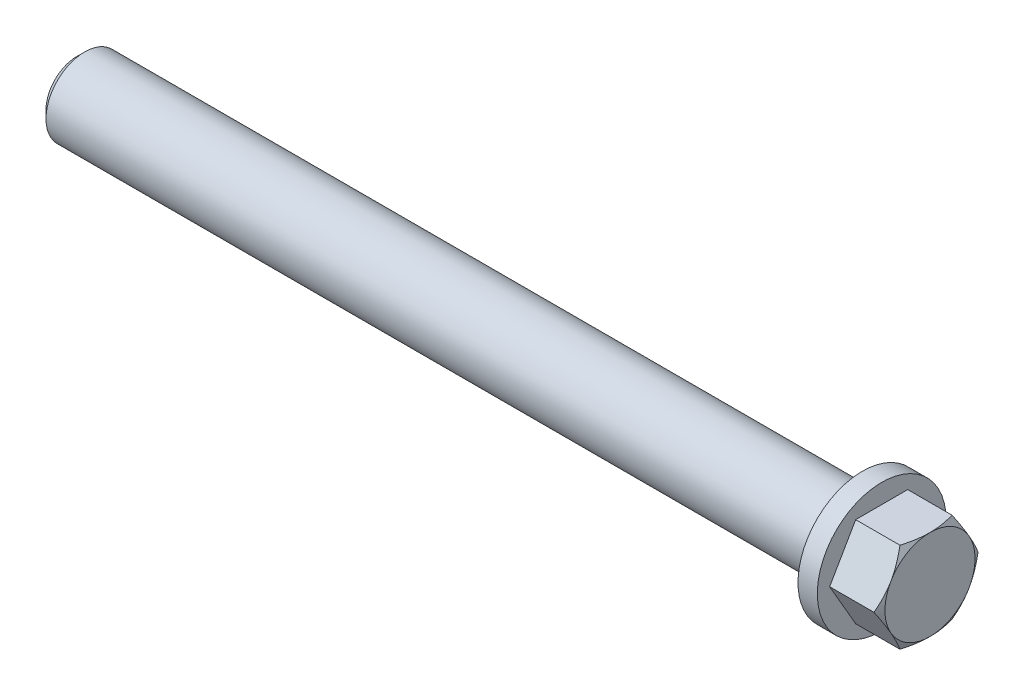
ISO-10303-21;
HEADER;
FILE_DESCRIPTION(('STEP AP214'),'2;1');
FILE_NAME('part.step','',(''),(''),'','','');
FILE_SCHEMA(('AUTOMOTIVE_DESIGN { 1 0 10303 214 1 1 1 1 }'));
ENDSEC;
DATA;
#1=APPLICATION_CONTEXT('core data for automotive mechanical design processes');
#2=APPLICATION_PROTOCOL_DEFINITION('international standard','automotive_design',2000,#1);
#3=PRODUCT_CONTEXT('',#1,'mechanical');
#4=PRODUCT('Part','Part','',(#3));
#5=PRODUCT_RELATED_PRODUCT_CATEGORY('part','',(#4));
#6=PRODUCT_DEFINITION_FORMATION('','',#4);
#7=PRODUCT_DEFINITION_CONTEXT('part definition',#1,'design');
#8=PRODUCT_DEFINITION('design','',#6,#7);
#9=PRODUCT_DEFINITION_SHAPE('','',#8);
#10=(LENGTH_UNIT() NAMED_UNIT(*) SI_UNIT(.MILLI.,.METRE.));
#11=(NAMED_UNIT(*) PLANE_ANGLE_UNIT() SI_UNIT($,.RADIAN.));
#12=(NAMED_UNIT(*) SI_UNIT($,.STERADIAN.) SOLID_ANGLE_UNIT());
#13=UNCERTAINTY_MEASURE_WITH_UNIT(LENGTH_MEASURE(1.E-05),#10,'distance_accuracy_value','');
#14=(GEOMETRIC_REPRESENTATION_CONTEXT(3) GLOBAL_UNCERTAINTY_ASSIGNED_CONTEXT((#13)) GLOBAL_UNIT_ASSIGNED_CONTEXT((#10,
#11,#12)) REPRESENTATION_CONTEXT('',''));
#15=CARTESIAN_POINT('',(0.,0.,0.));
#16=DIRECTION('',(0.,0.,1.));
#17=DIRECTION('',(1.,0.,0.));
#18=AXIS2_PLACEMENT_3D('',#15,#16,#17);
#19=CARTESIAN_POINT('',(7.5,-7.,-4.04145188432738));
#20=DIRECTION('',(0.,0.5,0.866025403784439));
#21=DIRECTION('',(0.,-0.866025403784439,0.5));
#22=AXIS2_PLACEMENT_3D('',#19,#20,#21);
#23=PLANE('',#22);
#24=DIRECTION('',(-1.,0.,0.));
#25=VECTOR('',#24,1.);
#26=CARTESIAN_POINT('',(7.5,0.,-8.08290376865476));
#27=LINE('',#26,#25);
#28=CARTESIAN_POINT('',(6.87478521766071,0.,-8.08290376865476));
#29=VERTEX_POINT('',#28);
#30=CARTESIAN_POINT('',(0.,0.,-8.08290376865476));
#31=VERTEX_POINT('',#30);
#32=EDGE_CURVE('E145',#29,#31,#27,.T.);
#33=ORIENTED_EDGE('',*,*,#32,.F.);
#34=CARTESIAN_POINT('',(6.8747185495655,0.0002,-8.0830192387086));
#35=CARTESIAN_POINT('',(6.92600015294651,-0.153667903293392,-7.99418356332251));
#36=CARTESIAN_POINT('',(6.97495440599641,-0.308109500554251,-7.90501666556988));
#37=CARTESIAN_POINT('',(7.06756721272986,-0.618246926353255,-7.72595873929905));
#38=CARTESIAN_POINT('',(7.11122348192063,-0.773943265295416,-7.63606741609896));
#39=CARTESIAN_POINT('',(7.2333884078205,-1.24352516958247,-7.36495417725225));
#40=CARTESIAN_POINT('',(7.30287444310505,-1.5592643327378,-7.18266208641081));
#41=CARTESIAN_POINT('',(7.3843550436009,-2.03176224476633,-6.9098652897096));
#42=CARTESIAN_POINT('',(7.40756651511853,-2.18710922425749,-6.82017566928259));
#43=CARTESIAN_POINT('',(7.44648878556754,-2.49850511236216,-6.64039116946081));
#44=CARTESIAN_POINT('',(7.46220024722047,-2.65455395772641,-6.55029632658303));
#45=CARTESIAN_POINT('',(7.48572208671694,-2.96692267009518,-6.36995016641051));
#46=CARTESIAN_POINT('',(7.49354143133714,-3.12324202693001,-6.27969914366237));
#47=CARTESIAN_POINT('',(7.50111975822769,-3.43601650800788,-6.09911871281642));
#48=CARTESIAN_POINT('',(7.50087898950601,-3.59247162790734,-6.00878930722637));
#49=CARTESIAN_POINT('',(7.4891402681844,-4.02110687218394,-5.76131663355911));
#50=CARTESIAN_POINT('',(7.46943425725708,-4.2931466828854,-5.60425437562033));
#51=CARTESIAN_POINT('',(7.40694653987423,-4.8354194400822,-5.29117305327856));
#52=CARTESIAN_POINT('',(7.36414347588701,-5.10565047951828,-5.13515508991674));
#53=CARTESIAN_POINT('',(7.25714832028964,-5.64901454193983,-4.82144370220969));
#54=CARTESIAN_POINT('',(7.19250290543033,-5.92207900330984,-4.66378986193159));
#55=CARTESIAN_POINT('',(7.04578392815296,-6.46413578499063,-4.35083323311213));
#56=CARTESIAN_POINT('',(6.96374482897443,-6.73313504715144,-4.19552643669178));
#57=CARTESIAN_POINT('',(6.8747185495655,-7.0002,-4.04133641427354));
#58=B_SPLINE_CURVE_WITH_KNOTS('',3,(#34,#35,#36,#37,#38,#39,#40,#41,#42,#43,#44,#45,#46,#47,#48,
#49,#50,#51,#52,#53,#54,#55,#56,#57),.UNSPECIFIED.,.F.,.F.,(4,2,2,2,2,2,2,2,2,2,2,4),(0.,
0.554727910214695,1.10969417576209,2.2219327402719,2.76443041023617,3.30688013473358,
3.8487128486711,4.39052882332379,5.33376515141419,6.27787517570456,7.2429241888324,
8.20607866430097),.UNSPECIFIED.);
#59=CARTESIAN_POINT('',(7.5,-3.5,-6.06217782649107));
#60=VERTEX_POINT('',#59);
#61=EDGE_CURVE('E228',#29,#60,#58,.T.);
#62=ORIENTED_EDGE('',*,*,#61,.T.);
#63=CARTESIAN_POINT('',(6.87478521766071,-7.,-4.04145188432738));
#64=VERTEX_POINT('',#63);
#65=EDGE_CURVE('E230',#60,#64,#58,.T.);
#66=ORIENTED_EDGE('',*,*,#65,.T.);
#67=DIRECTION('',(-1.,0.,0.));
#68=VECTOR('',#67,1.);
#69=CARTESIAN_POINT('',(7.5,-7.,-4.04145188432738));
#70=LINE('',#69,#68);
#71=CARTESIAN_POINT('',(0.,-7.,-4.04145188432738));
#72=VERTEX_POINT('',#71);
#73=EDGE_CURVE('E117',#64,#72,#70,.T.);
#74=ORIENTED_EDGE('',*,*,#73,.T.);
#75=DIRECTION('',(0.,0.866025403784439,-0.5));
#76=VECTOR('',#75,1.);
#77=CARTESIAN_POINT('',(0.,-7.,-4.04145188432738));
#78=LINE('',#77,#76);
#79=EDGE_CURVE('E113',#72,#31,#78,.T.);
#80=ORIENTED_EDGE('',*,*,#79,.T.);
#81=EDGE_LOOP('',(#33,#62,#66,#74,#80));
#82=FACE_BOUND('',#81,.T.);
#83=ADVANCED_FACE('F36',(#82),#23,.F.);
#84=CARTESIAN_POINT('',(7.5,0.,-8.08290376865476));
#85=DIRECTION('',(0.,-0.5,0.866025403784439));
#86=DIRECTION('',(0.,-0.866025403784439,-0.5));
#87=AXIS2_PLACEMENT_3D('',#84,#85,#86);
#88=PLANE('',#87);
#89=DIRECTION('',(-1.,0.,0.));
#90=VECTOR('',#89,1.);
#91=CARTESIAN_POINT('',(7.5,7.,-4.04145188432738));
#92=LINE('',#91,#90);
#93=CARTESIAN_POINT('',(6.87478521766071,7.,-4.04145188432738));
#94=VERTEX_POINT('',#93);
#95=CARTESIAN_POINT('',(0.,7.,-4.04145188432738));
#96=VERTEX_POINT('',#95);
#97=EDGE_CURVE('E142',#94,#96,#92,.T.);
#98=ORIENTED_EDGE('',*,*,#97,.F.);
#99=CARTESIAN_POINT('',(6.8747185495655,7.0002,-4.04133641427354));
#100=CARTESIAN_POINT('',(6.92600015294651,6.84633209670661,-4.13017208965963));
#101=CARTESIAN_POINT('',(6.97495440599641,6.69189049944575,-4.21933898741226));
#102=CARTESIAN_POINT('',(7.06756721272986,6.38175307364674,-4.39839691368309));
#103=CARTESIAN_POINT('',(7.11122348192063,6.22605673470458,-4.48828823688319));
#104=CARTESIAN_POINT('',(7.2333884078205,5.75647483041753,-4.75940147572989));
#105=CARTESIAN_POINT('',(7.30287444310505,5.4407356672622,-4.94169356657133));
#106=CARTESIAN_POINT('',(7.3843550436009,4.96823775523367,-5.21449036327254));
#107=CARTESIAN_POINT('',(7.40756651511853,4.81289077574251,-5.30417998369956));
#108=CARTESIAN_POINT('',(7.44648878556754,4.50149488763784,-5.48396448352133));
#109=CARTESIAN_POINT('',(7.46220024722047,4.34544604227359,-5.57405932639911));
#110=CARTESIAN_POINT('',(7.48572208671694,4.03307732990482,-5.75440548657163));
#111=CARTESIAN_POINT('',(7.49354143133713,3.87675797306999,-5.84465650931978));
#112=CARTESIAN_POINT('',(7.50111975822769,3.56398349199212,-6.02523694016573));
#113=CARTESIAN_POINT('',(7.50087898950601,3.40752837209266,-6.11556634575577));
#114=CARTESIAN_POINT('',(7.4891402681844,2.97889312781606,-6.36303901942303));
#115=CARTESIAN_POINT('',(7.46943425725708,2.7068533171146,-6.52010127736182));
#116=CARTESIAN_POINT('',(7.40694653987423,2.1645805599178,-6.83318259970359));
#117=CARTESIAN_POINT('',(7.36414347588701,1.89434952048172,-6.9892005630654));
#118=CARTESIAN_POINT('',(7.25714832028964,1.35098545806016,-7.30291195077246));
#119=CARTESIAN_POINT('',(7.19250290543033,1.07792099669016,-7.46056579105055));
#120=CARTESIAN_POINT('',(7.04578392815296,0.535864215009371,-7.77352241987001));
#121=CARTESIAN_POINT('',(6.96374482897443,0.26686495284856,-7.92882921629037));
#122=CARTESIAN_POINT('',(6.8747185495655,-0.000200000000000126,-8.0830192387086));
#123=B_SPLINE_CURVE_WITH_KNOTS('',3,(#99,#100,#101,#102,#103,#104,#105,#106,#107,#108,#109,#110,
#111,#112,#113,#114,#115,#116,#117,#118,#119,#120,#121,#122),.UNSPECIFIED.,.F.,.F.,(4,2,2,2,2,2,
2,2,2,2,2,4),(0.,0.554727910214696,1.10969417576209,2.2219327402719,2.76443041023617,
3.30688013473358,3.8487128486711,4.39052882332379,5.33376515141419,6.27787517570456,
7.2429241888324,8.20607866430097),.UNSPECIFIED.);
#124=CARTESIAN_POINT('',(7.5,3.5,-6.06217782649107));
#125=VERTEX_POINT('',#124);
#126=EDGE_CURVE('E219',#94,#125,#123,.T.);
#127=ORIENTED_EDGE('',*,*,#126,.T.);
#128=EDGE_CURVE('E193',#125,#29,#123,.T.);
#129=ORIENTED_EDGE('',*,*,#128,.T.);
#130=ORIENTED_EDGE('',*,*,#32,.T.);
#131=DIRECTION('',(0.,0.866025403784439,0.5));
#132=VECTOR('',#131,1.);
#133=CARTESIAN_POINT('',(0.,0.,-8.08290376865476));
#134=LINE('',#133,#132);
#135=EDGE_CURVE('E184',#31,#96,#134,.T.);
#136=ORIENTED_EDGE('',*,*,#135,.T.);
#137=EDGE_LOOP('',(#98,#127,#129,#130,#136));
#138=FACE_BOUND('',#137,.T.);
#139=ADVANCED_FACE('F207',(#138),#88,.F.);
#140=CARTESIAN_POINT('',(7.5,7.,-4.04145188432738));
#141=DIRECTION('',(0.,-1.,0.));
#142=DIRECTION('',(0.,0.,-1.));
#143=AXIS2_PLACEMENT_3D('',#140,#141,#142);
#144=PLANE('',#143);
#145=DIRECTION('',(-1.,0.,0.));
#146=VECTOR('',#145,1.);
#147=CARTESIAN_POINT('',(7.5,6.99999999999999,4.04145188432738));
#148=LINE('',#147,#146);
#149=CARTESIAN_POINT('',(6.87478521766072,6.99999999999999,4.04145188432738));
#150=VERTEX_POINT('',#149);
#151=CARTESIAN_POINT('',(0.,6.99999999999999,4.04145188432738));
#152=VERTEX_POINT('',#151);
#153=EDGE_CURVE('E139',#150,#152,#148,.T.);
#154=ORIENTED_EDGE('',*,*,#153,.F.);
#155=CARTESIAN_POINT('',(4.06584479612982,7.00000000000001,-10.8928464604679));
#156=CARTESIAN_POINT('',(4.21450026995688,7.00000000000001,-10.5867029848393));
#157=CARTESIAN_POINT('',(4.36174066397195,7.,-10.2798605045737));
#158=CARTESIAN_POINT('',(4.65259582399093,7.,-9.66440574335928));
#159=CARTESIAN_POINT('',(4.79621002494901,7.,-9.35579319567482));
#160=CARTESIAN_POINT('',(5.07973140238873,7.,-8.73485529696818));
#161=CARTESIAN_POINT('',(5.21961447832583,7.,-8.4225189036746));
#162=CARTESIAN_POINT('',(5.49370236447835,7.,-7.7953737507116));
#163=CARTESIAN_POINT('',(5.62790744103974,7.,-7.48056510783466));
#164=CARTESIAN_POINT('',(5.89331373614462,7.,-6.8378693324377));
#165=CARTESIAN_POINT('',(6.0242822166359,7.,-6.50988555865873));
#166=CARTESIAN_POINT('',(6.27639631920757,7.,-5.85009595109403));
#167=CARTESIAN_POINT('',(6.39754084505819,7.,-5.51828969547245));
#168=CARTESIAN_POINT('',(6.62685500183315,7.,-4.85093135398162));
#169=CARTESIAN_POINT('',(6.73505052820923,7.,-4.51538826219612));
#170=CARTESIAN_POINT('',(6.93502168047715,7.,-3.83950215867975));
#171=CARTESIAN_POINT('',(7.02680243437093,7.,-3.49916068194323));
#172=CARTESIAN_POINT('',(7.1890943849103,7.,-2.81522305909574));
#173=CARTESIAN_POINT('',(7.25971625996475,7.,-2.47165390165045));
#174=CARTESIAN_POINT('',(7.34671847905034,7.,-1.95314285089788));
#175=CARTESIAN_POINT('',(7.37256524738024,7.,-1.77976757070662));
#176=CARTESIAN_POINT('',(7.41744250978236,7.,-1.43214350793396));
#177=CARTESIAN_POINT('',(7.436473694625,7.,-1.25789481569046));
#178=CARTESIAN_POINT('',(7.467100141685,7.,-0.911049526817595));
#179=CARTESIAN_POINT('',(7.47878980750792,7.,-0.738461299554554));
#180=CARTESIAN_POINT('',(7.49485833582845,7.,-0.392945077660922));
#181=CARTESIAN_POINT('',(7.49923732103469,7.,-0.220017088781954));
#182=CARTESIAN_POINT('',(7.50057992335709,7.,0.125872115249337));
#183=CARTESIAN_POINT('',(7.49754340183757,7.,0.2988333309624));
#184=CARTESIAN_POINT('',(7.48412945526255,7.,0.644473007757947));
#185=CARTESIAN_POINT('',(7.47375167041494,7.,0.817151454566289));
#186=CARTESIAN_POINT('',(7.44031338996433,7.,1.23087218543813));
#187=CARTESIAN_POINT('',(7.41384108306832,7.,1.47164462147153));
#188=CARTESIAN_POINT('',(7.34805815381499,7.,1.9514167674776));
#189=CARTESIAN_POINT('',(7.30874582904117,6.99999999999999,2.19041623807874));
#190=CARTESIAN_POINT('',(7.17363274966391,6.99999999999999,2.90445905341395));
#191=CARTESIAN_POINT('',(7.06067846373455,6.99999999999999,3.37630026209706));
#192=CARTESIAN_POINT('',(6.86454385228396,6.99999999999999,4.0821986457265));
#193=CARTESIAN_POINT('',(6.79374157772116,6.99999999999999,4.31990513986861));
#194=CARTESIAN_POINT('',(6.64473048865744,6.99999999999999,4.7930081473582));
#195=CARTESIAN_POINT('',(6.5665216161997,6.99999999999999,5.02840464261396));
#196=CARTESIAN_POINT('',(6.40395697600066,6.99999999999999,5.49696607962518));
#197=CARTESIAN_POINT('',(6.31960307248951,6.99999999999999,5.73013167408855));
#198=CARTESIAN_POINT('',(6.14574648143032,6.99999999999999,6.19452230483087));
#199=CARTESIAN_POINT('',(6.05624392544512,6.99999999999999,6.42574739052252));
#200=CARTESIAN_POINT('',(5.79939160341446,6.99999999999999,7.0713958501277));
#201=CARTESIAN_POINT('',(5.62721890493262,6.99999999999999,7.4838990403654));
#202=CARTESIAN_POINT('',(5.272711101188,6.99999999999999,8.30453182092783));
#203=CARTESIAN_POINT('',(5.09037475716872,6.99999999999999,8.71266087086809));
#204=CARTESIAN_POINT('',(4.71806030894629,6.99999999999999,9.52561092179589));
#205=CARTESIAN_POINT('',(4.52807907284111,6.99999999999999,9.93043048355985));
#206=CARTESIAN_POINT('',(4.14238756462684,6.99999999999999,10.7372987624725));
#207=CARTESIAN_POINT('',(3.94667755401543,6.99999999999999,11.1393476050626));
#208=CARTESIAN_POINT('',(3.55049419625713,6.99999999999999,11.9419246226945));
#209=CARTESIAN_POINT('',(3.35001341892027,6.99999999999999,12.3424491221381));
#210=CARTESIAN_POINT('',(2.94555879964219,6.99999999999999,13.1417322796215));
#211=CARTESIAN_POINT('',(2.7415849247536,6.99999999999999,13.540490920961));
#212=CARTESIAN_POINT('',(2.33090289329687,6.99999999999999,14.3364753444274));
#213=CARTESIAN_POINT('',(2.1241954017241,6.99999999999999,14.7337014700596));
#214=CARTESIAN_POINT('',(1.70852695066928,6.99999999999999,15.526973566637));
#215=CARTESIAN_POINT('',(1.4995659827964,6.99999999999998,15.9230195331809));
#216=CARTESIAN_POINT('',(0.916803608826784,6.99999999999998,17.0213557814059));
#217=CARTESIAN_POINT('',(0.541023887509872,6.99999999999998,17.7225961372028));
#218=CARTESIAN_POINT('',(-0.214721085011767,6.99999999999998,19.1228739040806));
#219=CARTESIAN_POINT('',(-0.594686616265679,6.99999999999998,19.821911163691));
#220=CARTESIAN_POINT('',(-1.35641145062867,6.99999999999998,21.2159219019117));
#221=CARTESIAN_POINT('',(-1.73816026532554,6.99999999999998,21.9109011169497));
#222=CARTESIAN_POINT('',(-2.50401122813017,6.99999999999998,23.2994872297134));
#223=CARTESIAN_POINT('',(-2.8881131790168,6.99999999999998,23.9930942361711));
#224=CARTESIAN_POINT('',(-3.27306517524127,6.99999999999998,24.6862258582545));
#225=B_SPLINE_CURVE_WITH_KNOTS('',3,(#155,#156,#157,#158,#159,#160,#161,#162,#163,#164,#165,
#166,#167,#168,#169,#170,#171,#172,#173,#174,#175,#176,#177,#178,#179,#180,#181,#182,#183,#184,
#185,#186,#187,#188,#189,#190,#191,#192,#193,#194,#195,#196,#197,#198,#199,#200,#201,#202,#203,
#204,#205,#206,#207,#208,#209,#210,#211,#212,#213,#214,#215,#216,#217,#218,#219,#220,#221,#222,
#223,#224),.UNSPECIFIED.,.F.,.F.,(4,2,2,2,2,2,2,2,2,2,2,2,2,2,2,2,2,2,2,2,2,2,2,2,2,2,2,2,2,2,2,
2,2,2,4),(0.,1.02099246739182,2.04214305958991,3.06878742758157,4.09538358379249,
5.15475890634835,6.21425227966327,7.27159015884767,8.32859714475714,9.37997449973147,
9.90573557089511,10.4314433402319,10.9502447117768,11.469037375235,11.9878397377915,
12.5066675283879,13.2329284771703,13.9592857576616,15.4127396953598,16.1567571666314,
16.9007804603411,17.6445789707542,18.3883584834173,19.7291255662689,21.070056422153,
22.4115423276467,23.7529670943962,25.0966389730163,26.4403235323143,27.7836870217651,
29.1270555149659,31.5137750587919,33.9006552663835,36.2794216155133,38.6579912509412),.UNSPECIFIED.);
#226=CARTESIAN_POINT('',(7.5,7.,0.));
#227=VERTEX_POINT('',#226);
#228=EDGE_CURVE('E176',#150,#227,#225,.F.);
#229=ORIENTED_EDGE('',*,*,#228,.T.);
#230=EDGE_CURVE('E178',#227,#94,#225,.F.);
#231=ORIENTED_EDGE('',*,*,#230,.T.);
#232=ORIENTED_EDGE('',*,*,#97,.T.);
#233=DIRECTION('',(0.,0.,1.));
#234=VECTOR('',#233,1.);
#235=CARTESIAN_POINT('',(0.,7.,-4.04145188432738));
#236=LINE('',#235,#234);
#237=EDGE_CURVE('E133',#96,#152,#236,.T.);
#238=ORIENTED_EDGE('',*,*,#237,.T.);
#239=EDGE_LOOP('',(#154,#229,#231,#232,#238));
#240=FACE_BOUND('',#239,.T.);
#241=ADVANCED_FACE('F177',(#240),#144,.F.);
#242=CARTESIAN_POINT('',(7.5,6.99999999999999,4.04145188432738));
#243=DIRECTION('',(0.,-0.5,-0.866025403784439));
#244=DIRECTION('',(0.,0.866025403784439,-0.5));
#245=AXIS2_PLACEMENT_3D('',#242,#243,#244);
#246=PLANE('',#245);
#247=DIRECTION('',(-1.,0.,0.));
#248=VECTOR('',#247,1.);
#249=CARTESIAN_POINT('',(7.5,0.,8.08290376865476));
#250=LINE('',#249,#248);
#251=CARTESIAN_POINT('',(6.87478521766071,0.,8.08290376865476));
#252=VERTEX_POINT('',#251);
#253=CARTESIAN_POINT('',(0.,0.,8.08290376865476));
#254=VERTEX_POINT('',#253);
#255=EDGE_CURVE('E125',#252,#254,#250,.T.);
#256=ORIENTED_EDGE('',*,*,#255,.F.);
#257=CARTESIAN_POINT('',(6.8747185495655,-0.000200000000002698,8.0830192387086));
#258=CARTESIAN_POINT('',(6.92600015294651,0.153667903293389,7.99418356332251));
#259=CARTESIAN_POINT('',(6.97495440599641,0.308109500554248,7.90501666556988));
#260=CARTESIAN_POINT('',(7.06756721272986,0.618246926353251,7.72595873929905));
#261=CARTESIAN_POINT('',(7.11122348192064,0.773943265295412,7.63606741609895));
#262=CARTESIAN_POINT('',(7.23338840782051,1.24352516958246,7.36495417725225));
#263=CARTESIAN_POINT('',(7.30287444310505,1.5592643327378,7.18266208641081));
#264=CARTESIAN_POINT('',(7.3843550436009,2.03176224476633,6.9098652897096));
#265=CARTESIAN_POINT('',(7.40756651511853,2.18710922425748,6.82017566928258));
#266=CARTESIAN_POINT('',(7.44648878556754,2.49850511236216,6.64039116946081));
#267=CARTESIAN_POINT('',(7.46220024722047,2.65455395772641,6.55029632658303));
#268=CARTESIAN_POINT('',(7.48572208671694,2.96692267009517,6.36995016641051));
#269=CARTESIAN_POINT('',(7.49354143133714,3.12324202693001,6.27969914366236));
#270=CARTESIAN_POINT('',(7.5011197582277,3.43601650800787,6.09911871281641));
#271=CARTESIAN_POINT('',(7.50087898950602,3.59247162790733,6.00878930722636));
#272=CARTESIAN_POINT('',(7.4891402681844,4.02110687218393,5.76131663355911));
#273=CARTESIAN_POINT('',(7.46943425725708,4.2931466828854,5.60425437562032));
#274=CARTESIAN_POINT('',(7.40694653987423,4.83541944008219,5.29117305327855));
#275=CARTESIAN_POINT('',(7.36414347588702,5.10565047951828,5.13515508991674));
#276=CARTESIAN_POINT('',(7.25714832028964,5.64901454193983,4.82144370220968));
#277=CARTESIAN_POINT('',(7.19250290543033,5.92207900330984,4.66378986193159));
#278=CARTESIAN_POINT('',(7.04578392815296,6.46413578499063,4.35083323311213));
#279=CARTESIAN_POINT('',(6.96374482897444,6.73313504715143,4.19552643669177));
#280=CARTESIAN_POINT('',(6.8747185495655,7.00019999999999,4.04133641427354));
#281=B_SPLINE_CURVE_WITH_KNOTS('',3,(#257,#258,#259,#260,#261,#262,#263,#264,#265,#266,#267,
#268,#269,#270,#271,#272,#273,#274,#275,#276,#277,#278,#279,#280),.UNSPECIFIED.,.F.,.F.,(4,2,2,
2,2,2,2,2,2,2,2,4),(0.,0.554727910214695,1.10969417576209,2.2219327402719,2.76443041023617,
3.30688013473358,3.8487128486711,4.39052882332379,5.33376515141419,6.27787517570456,
7.2429241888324,8.20607866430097),.UNSPECIFIED.);
#282=CARTESIAN_POINT('',(7.5,3.5,6.06217782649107));
#283=VERTEX_POINT('',#282);
#284=EDGE_CURVE('E221',#252,#283,#281,.T.);
#285=ORIENTED_EDGE('',*,*,#284,.T.);
#286=EDGE_CURVE('E186',#283,#150,#281,.T.);
#287=ORIENTED_EDGE('',*,*,#286,.T.);
#288=ORIENTED_EDGE('',*,*,#153,.T.);
#289=DIRECTION('',(0.,-0.866025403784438,0.5));
#290=VECTOR('',#289,1.);
#291=CARTESIAN_POINT('',(0.,6.99999999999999,4.04145188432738));
#292=LINE('',#291,#290);
#293=EDGE_CURVE('E131',#152,#254,#292,.T.);
#294=ORIENTED_EDGE('',*,*,#293,.T.);
#295=EDGE_LOOP('',(#256,#285,#287,#288,#294));
#296=FACE_BOUND('',#295,.T.);
#297=ADVANCED_FACE('F206',(#296),#246,.F.);
#298=CARTESIAN_POINT('',(7.5,0.,8.08290376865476));
#299=DIRECTION('',(0.,0.5,-0.866025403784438));
#300=DIRECTION('',(0.,0.866025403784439,0.5));
#301=AXIS2_PLACEMENT_3D('',#298,#299,#300);
#302=PLANE('',#301);
#303=DIRECTION('',(-1.,0.,0.));
#304=VECTOR('',#303,1.);
#305=CARTESIAN_POINT('',(7.5,-7.,4.04145188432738));
#306=LINE('',#305,#304);
#307=CARTESIAN_POINT('',(6.87478521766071,-7.,4.04145188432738));
#308=VERTEX_POINT('',#307);
#309=CARTESIAN_POINT('',(0.,-7.,4.04145188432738));
#310=VERTEX_POINT('',#309);
#311=EDGE_CURVE('E120',#308,#310,#306,.T.);
#312=ORIENTED_EDGE('',*,*,#311,.F.);
#313=CARTESIAN_POINT('',(6.8747185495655,-7.0002,4.04133641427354));
#314=CARTESIAN_POINT('',(6.92600015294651,-6.84633209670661,4.13017208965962));
#315=CARTESIAN_POINT('',(6.97495440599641,-6.69189049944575,4.21933898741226));
#316=CARTESIAN_POINT('',(7.06756721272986,-6.38175307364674,4.39839691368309));
#317=CARTESIAN_POINT('',(7.11122348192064,-6.22605673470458,4.48828823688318));
#318=CARTESIAN_POINT('',(7.2333884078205,-5.75647483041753,4.75940147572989));
#319=CARTESIAN_POINT('',(7.30287444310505,-5.4407356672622,4.94169356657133));
#320=CARTESIAN_POINT('',(7.3843550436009,-4.96823775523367,5.21449036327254));
#321=CARTESIAN_POINT('',(7.40756651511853,-4.81289077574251,5.30417998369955));
#322=CARTESIAN_POINT('',(7.44648878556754,-4.50149488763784,5.48396448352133));
#323=CARTESIAN_POINT('',(7.46220024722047,-4.34544604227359,5.57405932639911));
#324=CARTESIAN_POINT('',(7.48572208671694,-4.03307732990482,5.75440548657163));
#325=CARTESIAN_POINT('',(7.49354143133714,-3.87675797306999,5.84465650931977));
#326=CARTESIAN_POINT('',(7.50111975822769,-3.56398349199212,6.02523694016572));
#327=CARTESIAN_POINT('',(7.50087898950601,-3.40752837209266,6.11556634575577));
#328=CARTESIAN_POINT('',(7.4891402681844,-2.97889312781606,6.36303901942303));
#329=CARTESIAN_POINT('',(7.46943425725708,-2.7068533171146,6.52010127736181));
#330=CARTESIAN_POINT('',(7.40694653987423,-2.1645805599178,6.83318259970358));
#331=CARTESIAN_POINT('',(7.36414347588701,-1.89434952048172,6.9892005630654));
#332=CARTESIAN_POINT('',(7.25714832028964,-1.35098545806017,7.30291195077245));
#333=CARTESIAN_POINT('',(7.19250290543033,-1.07792099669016,7.46056579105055));
#334=CARTESIAN_POINT('',(7.04578392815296,-0.535864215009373,7.77352241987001));
#335=CARTESIAN_POINT('',(6.96374482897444,-0.266864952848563,7.92882921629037));
#336=CARTESIAN_POINT('',(6.8747185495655,0.000199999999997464,8.0830192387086));
#337=B_SPLINE_CURVE_WITH_KNOTS('',3,(#313,#314,#315,#316,#317,#318,#319,#320,#321,#322,#323,
#324,#325,#326,#327,#328,#329,#330,#331,#332,#333,#334,#335,#336),.UNSPECIFIED.,.F.,.F.,(4,2,2,
2,2,2,2,2,2,2,2,4),(0.,0.554727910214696,1.10969417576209,2.2219327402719,2.76443041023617,
3.30688013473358,3.8487128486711,4.39052882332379,5.33376515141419,6.27787517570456,
7.2429241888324,8.20607866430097),.UNSPECIFIED.);
#338=CARTESIAN_POINT('',(7.5,-3.5,6.06217782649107));
#339=VERTEX_POINT('',#338);
#340=EDGE_CURVE('E56',#308,#339,#337,.T.);
#341=ORIENTED_EDGE('',*,*,#340,.T.);
#342=EDGE_CURVE('E227',#339,#252,#337,.T.);
#343=ORIENTED_EDGE('',*,*,#342,.T.);
#344=ORIENTED_EDGE('',*,*,#255,.T.);
#345=DIRECTION('',(0.,-0.866025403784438,-0.5));
#346=VECTOR('',#345,1.);
#347=CARTESIAN_POINT('',(0.,0.,8.08290376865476));
#348=LINE('',#347,#346);
#349=EDGE_CURVE('E110',#254,#310,#348,.T.);
#350=ORIENTED_EDGE('',*,*,#349,.T.);
#351=EDGE_LOOP('',(#312,#341,#343,#344,#350));
#352=FACE_BOUND('',#351,.T.);
#353=ADVANCED_FACE('F127',(#352),#302,.F.);
#354=CARTESIAN_POINT('',(7.5,-7.,4.04145188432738));
#355=DIRECTION('',(0.,1.,0.));
#356=DIRECTION('',(0.,0.,1.));
#357=AXIS2_PLACEMENT_3D('',#354,#355,#356);
#358=PLANE('',#357);
#359=ORIENTED_EDGE('',*,*,#73,.F.);
#360=CARTESIAN_POINT('',(4.06584479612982,-7.,-10.8928464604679));
#361=CARTESIAN_POINT('',(4.21450026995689,-7.,-10.5867029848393));
#362=CARTESIAN_POINT('',(4.36174066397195,-7.,-10.2798605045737));
#363=CARTESIAN_POINT('',(4.65259582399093,-7.,-9.66440574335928));
#364=CARTESIAN_POINT('',(4.79621002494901,-7.,-9.35579319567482));
#365=CARTESIAN_POINT('',(5.07973140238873,-7.,-8.73485529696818));
#366=CARTESIAN_POINT('',(5.21961447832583,-7.,-8.4225189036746));
#367=CARTESIAN_POINT('',(5.49370236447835,-7.,-7.7953737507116));
#368=CARTESIAN_POINT('',(5.62790744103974,-7.,-7.48056510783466));
#369=CARTESIAN_POINT('',(5.89331373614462,-7.,-6.8378693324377));
#370=CARTESIAN_POINT('',(6.0242822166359,-7.,-6.50988555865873));
#371=CARTESIAN_POINT('',(6.27639631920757,-7.,-5.85009595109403));
#372=CARTESIAN_POINT('',(6.39754084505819,-7.,-5.51828969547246));
#373=CARTESIAN_POINT('',(6.62685500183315,-7.,-4.85093135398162));
#374=CARTESIAN_POINT('',(6.73505052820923,-7.,-4.51538826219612));
#375=CARTESIAN_POINT('',(6.93502168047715,-7.,-3.83950215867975));
#376=CARTESIAN_POINT('',(7.02680243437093,-7.,-3.49916068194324));
#377=CARTESIAN_POINT('',(7.1890943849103,-7.,-2.81522305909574));
#378=CARTESIAN_POINT('',(7.25971625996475,-7.,-2.47165390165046));
#379=CARTESIAN_POINT('',(7.34671847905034,-7.,-1.95314285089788));
#380=CARTESIAN_POINT('',(7.37256524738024,-7.,-1.77976757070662));
#381=CARTESIAN_POINT('',(7.41744250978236,-7.,-1.43214350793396));
#382=CARTESIAN_POINT('',(7.436473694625,-7.,-1.25789481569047));
#383=CARTESIAN_POINT('',(7.467100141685,-7.,-0.911049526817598));
#384=CARTESIAN_POINT('',(7.47878980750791,-7.,-0.738461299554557));
#385=CARTESIAN_POINT('',(7.49485833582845,-7.,-0.392945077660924));
#386=CARTESIAN_POINT('',(7.49923732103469,-7.,-0.220017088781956));
#387=CARTESIAN_POINT('',(7.50057992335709,-7.,0.125872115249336));
#388=CARTESIAN_POINT('',(7.49754340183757,-7.,0.2988333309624));
#389=CARTESIAN_POINT('',(7.48412945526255,-7.,0.644473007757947));
#390=CARTESIAN_POINT('',(7.47375167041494,-7.,0.81715145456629));
#391=CARTESIAN_POINT('',(7.44031338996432,-7.,1.23087218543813));
#392=CARTESIAN_POINT('',(7.41384108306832,-7.,1.47164462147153));
#393=CARTESIAN_POINT('',(7.34805815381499,-7.,1.9514167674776));
#394=CARTESIAN_POINT('',(7.30874582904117,-7.,2.19041623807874));
#395=CARTESIAN_POINT('',(7.17363274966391,-7.,2.90445905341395));
#396=CARTESIAN_POINT('',(7.06067846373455,-7.,3.37630026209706));
#397=CARTESIAN_POINT('',(6.86454385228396,-7.,4.0821986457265));
#398=CARTESIAN_POINT('',(6.79374157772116,-7.,4.31990513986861));
#399=CARTESIAN_POINT('',(6.64473048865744,-7.,4.7930081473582));
#400=CARTESIAN_POINT('',(6.56652161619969,-7.,5.02840464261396));
#401=CARTESIAN_POINT('',(6.40395697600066,-7.,5.49696607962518));
#402=CARTESIAN_POINT('',(6.3196030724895,-7.,5.73013167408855));
#403=CARTESIAN_POINT('',(6.14574648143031,-7.,6.19452230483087));
#404=CARTESIAN_POINT('',(6.05624392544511,-7.,6.42574739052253));
#405=CARTESIAN_POINT('',(5.79939160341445,-7.,7.07139585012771));
#406=CARTESIAN_POINT('',(5.62721890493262,-7.,7.4838990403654));
#407=CARTESIAN_POINT('',(5.27271110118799,-7.,8.30453182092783));
#408=CARTESIAN_POINT('',(5.09037475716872,-7.,8.71266087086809));
#409=CARTESIAN_POINT('',(4.71806030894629,-7.,9.52561092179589));
#410=CARTESIAN_POINT('',(4.5280790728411,-7.,9.93043048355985));
#411=CARTESIAN_POINT('',(4.14238756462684,-7.,10.7372987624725));
#412=CARTESIAN_POINT('',(3.94667755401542,-7.,11.1393476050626));
#413=CARTESIAN_POINT('',(3.55049419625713,-7.,11.9419246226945));
#414=CARTESIAN_POINT('',(3.35001341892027,-7.,12.3424491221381));
#415=CARTESIAN_POINT('',(2.94555879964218,-7.,13.1417322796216));
#416=CARTESIAN_POINT('',(2.7415849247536,-7.,13.540490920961));
#417=CARTESIAN_POINT('',(2.33090289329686,-7.,14.3364753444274));
#418=CARTESIAN_POINT('',(2.12419540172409,-7.,14.7337014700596));
#419=CARTESIAN_POINT('',(1.70852695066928,-7.,15.526973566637));
#420=CARTESIAN_POINT('',(1.4995659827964,-7.,15.9230195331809));
#421=CARTESIAN_POINT('',(0.91680360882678,-7.,17.0213557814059));
#422=CARTESIAN_POINT('',(0.541023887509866,-7.,17.7225961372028));
#423=CARTESIAN_POINT('',(-0.214721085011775,-7.,19.1228739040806));
#424=CARTESIAN_POINT('',(-0.594686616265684,-7.,19.821911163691));
#425=CARTESIAN_POINT('',(-1.35641145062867,-7.,21.2159219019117));
#426=CARTESIAN_POINT('',(-1.73816026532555,-7.,21.9109011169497));
#427=CARTESIAN_POINT('',(-2.50401122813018,-7.,23.2994872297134));
#428=CARTESIAN_POINT('',(-2.88811317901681,-7.,23.9930942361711));
#429=CARTESIAN_POINT('',(-3.27306517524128,-7.,24.6862258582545));
#430=B_SPLINE_CURVE_WITH_KNOTS('',3,(#360,#361,#362,#363,#364,#365,#366,#367,#368,#369,#370,
#371,#372,#373,#374,#375,#376,#377,#378,#379,#380,#381,#382,#383,#384,#385,#386,#387,#388,#389,
#390,#391,#392,#393,#394,#395,#396,#397,#398,#399,#400,#401,#402,#403,#404,#405,#406,#407,#408,
#409,#410,#411,#412,#413,#414,#415,#416,#417,#418,#419,#420,#421,#422,#423,#424,#425,#426,#427,
#428,#429),.UNSPECIFIED.,.F.,.F.,(4,2,2,2,2,2,2,2,2,2,2,2,2,2,2,2,2,2,2,2,2,2,2,2,2,2,2,2,2,2,2,
2,2,2,4),(0.,1.02099246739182,2.04214305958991,3.06878742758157,4.09538358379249,
5.15475890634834,6.21425227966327,7.27159015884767,8.32859714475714,9.37997449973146,
9.9057355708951,10.4314433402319,10.9502447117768,11.469037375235,11.9878397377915,
12.5066675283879,13.2329284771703,13.9592857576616,15.4127396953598,16.1567571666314,
16.9007804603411,17.6445789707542,18.3883584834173,19.7291255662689,21.070056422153,
22.4115423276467,23.7529670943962,25.0966389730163,26.4403235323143,27.7836870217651,
29.1270555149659,31.5137750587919,33.9006552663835,36.2794216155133,38.6579912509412),.UNSPECIFIED.);
#431=CARTESIAN_POINT('',(7.5,-7.,0.));
#432=VERTEX_POINT('',#431);
#433=EDGE_CURVE('E235',#64,#432,#430,.T.);
#434=ORIENTED_EDGE('',*,*,#433,.T.);
#435=EDGE_CURVE('E123',#432,#308,#430,.T.);
#436=ORIENTED_EDGE('',*,*,#435,.T.);
#437=ORIENTED_EDGE('',*,*,#311,.T.);
#438=DIRECTION('',(0.,0.,-1.));
#439=VECTOR('',#438,1.);
#440=CARTESIAN_POINT('',(0.,-7.,4.04145188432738));
#441=LINE('',#440,#439);
#442=EDGE_CURVE('E106',#310,#72,#441,.T.);
#443=ORIENTED_EDGE('',*,*,#442,.T.);
#444=EDGE_LOOP('',(#359,#434,#436,#437,#443));
#445=FACE_BOUND('',#444,.T.);
#446=ADVANCED_FACE('F121',(#445),#358,.F.);
#447=CARTESIAN_POINT('',(7.5,0.,0.));
#448=DIRECTION('',(-1.,0.,0.));
#449=DIRECTION('',(0.,0.,1.));
#450=AXIS2_PLACEMENT_3D('',#447,#448,#449);
#451=CONICAL_SURFACE('',#450,7.,1.0471975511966);
#452=ORIENTED_EDGE('',*,*,#342,.F.);
#453=CARTESIAN_POINT('',(7.5,0.,0.));
#454=DIRECTION('',(-1.,0.,0.));
#455=DIRECTION('',(0.,0.,1.));
#456=AXIS2_PLACEMENT_3D('',#453,#454,#455);
#457=CIRCLE('',#456,7.);
#458=EDGE_CURVE('E148',#283,#339,#457,.F.);
#459=ORIENTED_EDGE('',*,*,#458,.F.);
#460=ORIENTED_EDGE('',*,*,#284,.F.);
#461=EDGE_LOOP('',(#452,#459,#460));
#462=FACE_BOUND('',#461,.T.);
#463=ADVANCED_FACE('F246',(#462),#451,.T.);
#464=ORIENTED_EDGE('',*,*,#286,.F.);
#465=CARTESIAN_POINT('',(7.5,0.,0.));
#466=DIRECTION('',(-1.,0.,0.));
#467=DIRECTION('',(0.,0.,1.));
#468=AXIS2_PLACEMENT_3D('',#465,#466,#467);
#469=CIRCLE('',#468,7.);
#470=EDGE_CURVE('E170',#283,#227,#469,.T.);
#471=ORIENTED_EDGE('',*,*,#470,.T.);
#472=ORIENTED_EDGE('',*,*,#228,.F.);
#473=EDGE_LOOP('',(#464,#471,#472));
#474=FACE_BOUND('',#473,.T.);
#475=ADVANCED_FACE('F199',(#474),#451,.T.);
#476=EDGE_CURVE('E151',#125,#227,#457,.F.);
#477=ORIENTED_EDGE('',*,*,#476,.F.);
#478=ORIENTED_EDGE('',*,*,#126,.F.);
#479=ORIENTED_EDGE('',*,*,#230,.F.);
#480=EDGE_LOOP('',(#477,#478,#479));
#481=FACE_BOUND('',#480,.T.);
#482=ADVANCED_FACE('F328',(#481),#451,.T.);
#483=EDGE_CURVE('E158',#60,#125,#457,.F.);
#484=ORIENTED_EDGE('',*,*,#483,.F.);
#485=ORIENTED_EDGE('',*,*,#61,.F.);
#486=ORIENTED_EDGE('',*,*,#128,.F.);
#487=EDGE_LOOP('',(#484,#485,#486));
#488=FACE_BOUND('',#487,.T.);
#489=ADVANCED_FACE('F319',(#488),#451,.T.);
#490=EDGE_CURVE('E155',#432,#60,#457,.F.);
#491=ORIENTED_EDGE('',*,*,#490,.F.);
#492=ORIENTED_EDGE('',*,*,#433,.F.);
#493=ORIENTED_EDGE('',*,*,#65,.F.);
#494=EDGE_LOOP('',(#491,#492,#493));
#495=FACE_BOUND('',#494,.T.);
#496=ADVANCED_FACE('F311',(#495),#451,.T.);
#497=ORIENTED_EDGE('',*,*,#435,.F.);
#498=EDGE_CURVE('E52',#339,#432,#457,.F.);
#499=ORIENTED_EDGE('',*,*,#498,.F.);
#500=ORIENTED_EDGE('',*,*,#340,.F.);
#501=EDGE_LOOP('',(#497,#499,#500));
#502=FACE_BOUND('',#501,.T.);
#503=ADVANCED_FACE('F302',(#502),#451,.T.);
#504=CARTESIAN_POINT('',(7.5,-7.,-4.04145188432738));
#505=DIRECTION('',(-1.,0.,0.));
#506=DIRECTION('',(0.,0.,1.));
#507=AXIS2_PLACEMENT_3D('',#504,#505,#506);
#508=PLANE('',#507);
#509=ORIENTED_EDGE('',*,*,#458,.T.);
#510=ORIENTED_EDGE('',*,*,#498,.T.);
#511=ORIENTED_EDGE('',*,*,#490,.T.);
#512=ORIENTED_EDGE('',*,*,#483,.T.);
#513=ORIENTED_EDGE('',*,*,#476,.T.);
#514=ORIENTED_EDGE('',*,*,#470,.F.);
#515=EDGE_LOOP('',(#509,#510,#511,#512,#513,#514));
#516=FACE_BOUND('',#515,.T.);
#517=ADVANCED_FACE('F168',(#516),#508,.F.);
#518=CARTESIAN_POINT('',(0.,0.,0.));
#519=DIRECTION('',(1.,0.,0.));
#520=DIRECTION('',(0.,0.,-1.));
#521=AXIS2_PLACEMENT_3D('',#518,#519,#520);
#522=PLANE('',#521);
#523=CARTESIAN_POINT('',(0.,0.,0.));
#524=DIRECTION('',(1.,0.,0.));
#525=DIRECTION('',(0.,0.,-1.));
#526=AXIS2_PLACEMENT_3D('',#523,#524,#525);
#527=CIRCLE('',#526,10.);
#528=CARTESIAN_POINT('',(0.,0.,-10.));
#529=VERTEX_POINT('',#528);
#530=EDGE_CURVE('E422',#529,#529,#527,.T.);
#531=ORIENTED_EDGE('',*,*,#530,.T.);
#532=EDGE_LOOP('',(#531));
#533=FACE_BOUND('',#532,.T.);
#534=ORIENTED_EDGE('',*,*,#79,.F.);
#535=ORIENTED_EDGE('',*,*,#442,.F.);
#536=ORIENTED_EDGE('',*,*,#349,.F.);
#537=ORIENTED_EDGE('',*,*,#293,.F.);
#538=ORIENTED_EDGE('',*,*,#237,.F.);
#539=ORIENTED_EDGE('',*,*,#135,.F.);
#540=EDGE_LOOP('',(#534,#535,#536,#537,#538,#539));
#541=FACE_BOUND('',#540,.T.);
#542=ADVANCED_FACE('F108',(#533,#541),#522,.T.);
#543=CARTESIAN_POINT('',(-3.,0.,0.));
#544=DIRECTION('',(-1.,0.,0.));
#545=DIRECTION('',(0.,0.,1.));
#546=AXIS2_PLACEMENT_3D('',#543,#544,#545);
#547=PLANE('',#546);
#548=CARTESIAN_POINT('',(-3.,0.,0.));
#549=DIRECTION('',(1.,0.,0.));
#550=DIRECTION('',(0.,0.,-1.));
#551=AXIS2_PLACEMENT_3D('',#548,#549,#550);
#552=CIRCLE('',#551,10.);
#553=CARTESIAN_POINT('',(-3.,0.,-10.));
#554=VERTEX_POINT('',#553);
#555=EDGE_CURVE('E424',#554,#554,#552,.T.);
#556=ORIENTED_EDGE('',*,*,#555,.F.);
#557=EDGE_LOOP('',(#556));
#558=FACE_BOUND('',#557,.T.);
#559=CARTESIAN_POINT('',(-3.,0.,0.));
#560=DIRECTION('',(-1.,0.,0.));
#561=DIRECTION('',(0.,0.,1.));
#562=AXIS2_PLACEMENT_3D('',#559,#560,#561);
#563=CIRCLE('',#562,6.);
#564=CARTESIAN_POINT('',(-3.,0.,6.));
#565=VERTEX_POINT('',#564);
#566=EDGE_CURVE('E40',#565,#565,#563,.T.);
#567=ORIENTED_EDGE('',*,*,#566,.F.);
#568=EDGE_LOOP('',(#567));
#569=FACE_BOUND('',#568,.T.);
#570=ADVANCED_FACE('F376',(#558,#569),#547,.T.);
#571=CARTESIAN_POINT('',(0.,0.,0.));
#572=DIRECTION('',(1.,0.,0.));
#573=DIRECTION('',(0.,0.,-1.));
#574=AXIS2_PLACEMENT_3D('',#571,#572,#573);
#575=CYLINDRICAL_SURFACE('',#574,10.);
#576=ORIENTED_EDGE('',*,*,#555,.T.);
#577=EDGE_LOOP('',(#576));
#578=FACE_BOUND('',#577,.T.);
#579=ORIENTED_EDGE('',*,*,#530,.F.);
#580=EDGE_LOOP('',(#579));
#581=FACE_BOUND('',#580,.T.);
#582=ADVANCED_FACE('F291',(#578,#581),#575,.T.);
#583=CARTESIAN_POINT('',(-125.,0.,0.));
#584=DIRECTION('',(-1.,0.,0.));
#585=DIRECTION('',(0.,0.,1.));
#586=AXIS2_PLACEMENT_3D('',#583,#584,#585);
#587=PLANE('',#586);
#588=CARTESIAN_POINT('',(-125.,0.,0.));
#589=DIRECTION('',(-1.,0.,0.));
#590=DIRECTION('',(0.,0.,1.));
#591=AXIS2_PLACEMENT_3D('',#588,#589,#590);
#592=CIRCLE('',#591,4.8);
#593=CARTESIAN_POINT('',(-125.,0.,4.8));
#594=VERTEX_POINT('',#593);
#595=EDGE_CURVE('E45',#594,#594,#592,.T.);
#596=ORIENTED_EDGE('',*,*,#595,.T.);
#597=EDGE_LOOP('',(#596));
#598=FACE_BOUND('',#597,.T.);
#599=ADVANCED_FACE('F279',(#598),#587,.T.);
#600=CARTESIAN_POINT('',(-125.,0.,0.));
#601=DIRECTION('',(1.,0.,0.));
#602=DIRECTION('',(0.,0.,-1.));
#603=AXIS2_PLACEMENT_3D('',#600,#601,#602);
#604=CONICAL_SURFACE('',#603,4.8,0.785398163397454);
#605=CARTESIAN_POINT('',(-123.8,0.,0.));
#606=DIRECTION('',(-1.,0.,0.));
#607=DIRECTION('',(0.,0.,1.));
#608=AXIS2_PLACEMENT_3D('',#605,#606,#607);
#609=CIRCLE('',#608,6.);
#610=CARTESIAN_POINT('',(-123.8,0.,6.));
#611=VERTEX_POINT('',#610);
#612=EDGE_CURVE('E11',#611,#611,#609,.F.);
#613=ORIENTED_EDGE('',*,*,#612,.F.);
#614=EDGE_LOOP('',(#613));
#615=FACE_BOUND('',#614,.T.);
#616=ORIENTED_EDGE('',*,*,#595,.F.);
#617=EDGE_LOOP('',(#616));
#618=FACE_BOUND('',#617,.T.);
#619=ADVANCED_FACE('F272',(#615,#618),#604,.T.);
#620=CARTESIAN_POINT('',(-125.,0.,0.));
#621=DIRECTION('',(1.,0.,0.));
#622=DIRECTION('',(0.,0.,-1.));
#623=AXIS2_PLACEMENT_3D('',#620,#621,#622);
#624=CYLINDRICAL_SURFACE('',#623,6.);
#625=ORIENTED_EDGE('',*,*,#612,.T.);
#626=EDGE_LOOP('',(#625));
#627=FACE_BOUND('',#626,.T.);
#628=ORIENTED_EDGE('',*,*,#566,.T.);
#629=EDGE_LOOP('',(#628));
#630=FACE_BOUND('',#629,.T.);
#631=ADVANCED_FACE('F278',(#627,#630),#624,.T.);
#632=CLOSED_SHELL('',(#83,#139,#241,#297,#353,#446,#463,#475,#482,#489,#496,#503,#517,#542,#570,
#582,#599,#619,#631));
#633=MANIFOLD_SOLID_BREP('B2',#632);
#634=ADVANCED_BREP_SHAPE_REPRESENTATION('',(#18,#633),#14);
#635=SHAPE_DEFINITION_REPRESENTATION(#9,#634);
ENDSEC;
END-ISO-10303-21;
